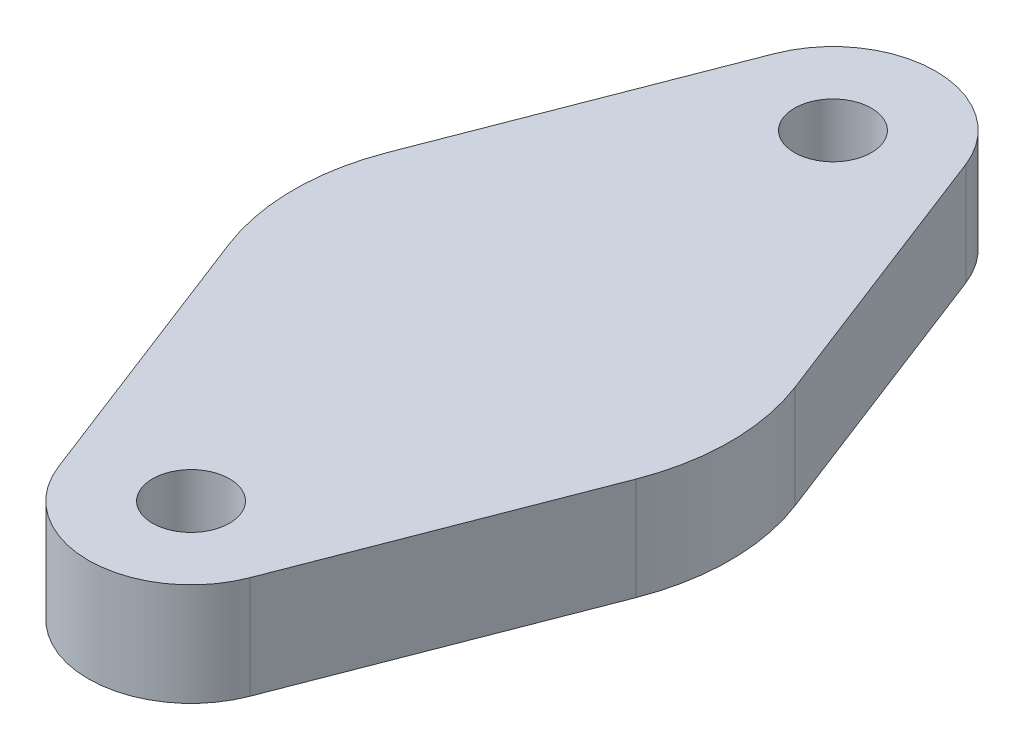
ISO-10303-21;
HEADER;
FILE_DESCRIPTION(('STEP AP214'),'2;1');
FILE_NAME('part.step','',(''),(''),'','','');
FILE_SCHEMA(('AUTOMOTIVE_DESIGN { 1 0 10303 214 1 1 1 1 }'));
ENDSEC;
DATA;
#1=APPLICATION_CONTEXT('core data for automotive mechanical design processes');
#2=APPLICATION_PROTOCOL_DEFINITION('international standard','automotive_design',2000,#1);
#3=PRODUCT_CONTEXT('',#1,'mechanical');
#4=PRODUCT('Part','Part','',(#3));
#5=PRODUCT_RELATED_PRODUCT_CATEGORY('part','',(#4));
#6=PRODUCT_DEFINITION_FORMATION('','',#4);
#7=PRODUCT_DEFINITION_CONTEXT('part definition',#1,'design');
#8=PRODUCT_DEFINITION('design','',#6,#7);
#9=PRODUCT_DEFINITION_SHAPE('','',#8);
#10=(LENGTH_UNIT() NAMED_UNIT(*) SI_UNIT(.MILLI.,.METRE.));
#11=(NAMED_UNIT(*) PLANE_ANGLE_UNIT() SI_UNIT($,.RADIAN.));
#12=(NAMED_UNIT(*) SI_UNIT($,.STERADIAN.) SOLID_ANGLE_UNIT());
#13=UNCERTAINTY_MEASURE_WITH_UNIT(LENGTH_MEASURE(1.E-05),#10,'distance_accuracy_value','');
#14=(GEOMETRIC_REPRESENTATION_CONTEXT(3) GLOBAL_UNCERTAINTY_ASSIGNED_CONTEXT((#13)) GLOBAL_UNIT_ASSIGNED_CONTEXT((#10,
#11,#12)) REPRESENTATION_CONTEXT('',''));
#15=CARTESIAN_POINT('',(0.,0.,0.));
#16=DIRECTION('',(0.,0.,1.));
#17=DIRECTION('',(1.,0.,0.));
#18=AXIS2_PLACEMENT_3D('',#15,#16,#17);
#19=CARTESIAN_POINT('',(0.,2.,0.));
#20=DIRECTION('',(0.,1.,0.));
#21=DIRECTION('',(0.,0.,1.));
#22=AXIS2_PLACEMENT_3D('',#19,#20,#21);
#23=PLANE('',#22);
#24=CARTESIAN_POINT('',(0.,2.,12.5));
#25=DIRECTION('',(0.,1.,0.));
#26=DIRECTION('',(0.,0.,1.));
#27=AXIS2_PLACEMENT_3D('',#24,#25,#26);
#28=CIRCLE('',#27,1.5);
#29=CARTESIAN_POINT('',(0.,2.,14.));
#30=VERTEX_POINT('',#29);
#31=EDGE_CURVE('E161',#30,#30,#28,.F.);
#32=ORIENTED_EDGE('',*,*,#31,.T.);
#33=EDGE_LOOP('',(#32));
#34=FACE_BOUND('',#33,.T.);
#35=CARTESIAN_POINT('',(0.,2.,-12.5));
#36=DIRECTION('',(0.,1.,0.));
#37=DIRECTION('',(0.,0.,1.));
#38=AXIS2_PLACEMENT_3D('',#35,#36,#37);
#39=CIRCLE('',#38,1.5);
#40=CARTESIAN_POINT('',(0.,2.,-11.));
#41=VERTEX_POINT('',#40);
#42=EDGE_CURVE('E165',#41,#41,#39,.F.);
#43=ORIENTED_EDGE('',*,*,#42,.T.);
#44=EDGE_LOOP('',(#43));
#45=FACE_BOUND('',#44,.T.);
#46=DIRECTION('',(-0.360538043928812,0.,-0.93274450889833));
#47=VECTOR('',#46,1.);
#48=CARTESIAN_POINT('',(7.921602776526,2.,-3.100627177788));
#49=LINE('',#48,#47);
#50=CARTESIAN_POINT('',(3.73097803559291,2.,-13.9421521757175));
#51=VERTEX_POINT('',#50);
#52=CARTESIAN_POINT('',(7.92160277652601,2.,-3.10062717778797));
#53=VERTEX_POINT('',#52);
#54=EDGE_CURVE('E111',#51,#53,#49,.F.);
#55=ORIENTED_EDGE('',*,*,#54,.F.);
#56=CARTESIAN_POINT('',(0.,2.,-12.5));
#57=DIRECTION('',(0.,1.,0.));
#58=DIRECTION('',(0.,0.,1.));
#59=AXIS2_PLACEMENT_3D('',#56,#57,#58);
#60=CIRCLE('',#59,4.);
#61=CARTESIAN_POINT('',(-3.73097803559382,2.,-13.9421521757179));
#62=VERTEX_POINT('',#61);
#63=EDGE_CURVE('E20',#62,#51,#60,.F.);
#64=ORIENTED_EDGE('',*,*,#63,.F.);
#65=DIRECTION('',(-0.360538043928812,0.,0.93274450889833));
#66=VECTOR('',#65,1.);
#67=CARTESIAN_POINT('',(-3.730978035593,2.,-13.94215217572));
#68=LINE('',#67,#66);
#69=CARTESIAN_POINT('',(-7.92160277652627,2.,-3.10062717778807));
#70=VERTEX_POINT('',#69);
#71=EDGE_CURVE('E96',#70,#62,#68,.F.);
#72=ORIENTED_EDGE('',*,*,#71,.F.);
#73=CARTESIAN_POINT('',(0.1,2.,0.));
#74=DIRECTION('',(0.,1.,0.));
#75=DIRECTION('',(0.,0.,1.));
#76=AXIS2_PLACEMENT_3D('',#73,#74,#75);
#77=CIRCLE('',#76,8.6);
#78=CARTESIAN_POINT('',(-7.92160277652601,2.,3.10062717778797));
#79=VERTEX_POINT('',#78);
#80=EDGE_CURVE('E120',#79,#70,#77,.F.);
#81=ORIENTED_EDGE('',*,*,#80,.F.);
#82=DIRECTION('',(0.360538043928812,0.,0.93274450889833));
#83=VECTOR('',#82,1.);
#84=CARTESIAN_POINT('',(-7.921602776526,2.,3.100627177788));
#85=LINE('',#84,#83);
#86=CARTESIAN_POINT('',(-3.73097803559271,2.,13.9421521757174));
#87=VERTEX_POINT('',#86);
#88=EDGE_CURVE('E137',#87,#79,#85,.F.);
#89=ORIENTED_EDGE('',*,*,#88,.F.);
#90=CARTESIAN_POINT('',(0.,2.,12.5));
#91=DIRECTION('',(0.,1.,0.));
#92=DIRECTION('',(0.,0.,1.));
#93=AXIS2_PLACEMENT_3D('',#90,#91,#92);
#94=CIRCLE('',#93,4.);
#95=CARTESIAN_POINT('',(3.73097803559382,2.,13.9421521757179));
#96=VERTEX_POINT('',#95);
#97=EDGE_CURVE('E173',#96,#87,#94,.F.);
#98=ORIENTED_EDGE('',*,*,#97,.F.);
#99=DIRECTION('',(0.360538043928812,0.,-0.93274450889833));
#100=VECTOR('',#99,1.);
#101=CARTESIAN_POINT('',(3.730978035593,2.,13.94215217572));
#102=LINE('',#101,#100);
#103=CARTESIAN_POINT('',(7.92160277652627,2.,3.10062717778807));
#104=VERTEX_POINT('',#103);
#105=EDGE_CURVE('E132',#104,#96,#102,.F.);
#106=ORIENTED_EDGE('',*,*,#105,.F.);
#107=CARTESIAN_POINT('',(-0.1,2.,0.));
#108=DIRECTION('',(0.,1.,0.));
#109=DIRECTION('',(0.,0.,1.));
#110=AXIS2_PLACEMENT_3D('',#107,#108,#109);
#111=CIRCLE('',#110,8.6);
#112=EDGE_CURVE('E169',#53,#104,#111,.F.);
#113=ORIENTED_EDGE('',*,*,#112,.F.);
#114=EDGE_LOOP('',(#55,#64,#72,#81,#89,#98,#106,#113));
#115=FACE_BOUND('',#114,.T.);
#116=ADVANCED_FACE('F17',(#34,#45,#115),#23,.T.);
#117=CARTESIAN_POINT('',(0.,-2.,-12.5));
#118=DIRECTION('',(0.,1.,0.));
#119=DIRECTION('',(0.,0.,1.));
#120=AXIS2_PLACEMENT_3D('',#117,#118,#119);
#121=CYLINDRICAL_SURFACE('',#120,4.);
#122=DIRECTION('',(0.,1.,0.));
#123=VECTOR('',#122,1.);
#124=CARTESIAN_POINT('',(3.73097803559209,-2.,-13.9421521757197));
#125=LINE('',#124,#123);
#126=CARTESIAN_POINT('',(3.73097803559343,-2.,-13.9421521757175));
#127=VERTEX_POINT('',#126);
#128=EDGE_CURVE('E131',#127,#51,#125,.T.);
#129=ORIENTED_EDGE('',*,*,#128,.F.);
#130=CARTESIAN_POINT('',(0.,-2.,-12.5));
#131=DIRECTION('',(0.,1.,0.));
#132=DIRECTION('',(0.,0.,1.));
#133=AXIS2_PLACEMENT_3D('',#130,#131,#132);
#134=CIRCLE('',#133,4.);
#135=CARTESIAN_POINT('',(-3.73097803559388,-2.,-13.9421521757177));
#136=VERTEX_POINT('',#135);
#137=EDGE_CURVE('E118',#127,#136,#134,.T.);
#138=ORIENTED_EDGE('',*,*,#137,.T.);
#139=DIRECTION('',(0.,1.,0.));
#140=VECTOR('',#139,1.);
#141=CARTESIAN_POINT('',(-3.730978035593,-2.,-13.94215217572));
#142=LINE('',#141,#140);
#143=EDGE_CURVE('E101',#62,#136,#142,.F.);
#144=ORIENTED_EDGE('',*,*,#143,.F.);
#145=ORIENTED_EDGE('',*,*,#63,.T.);
#146=EDGE_LOOP('',(#129,#138,#144,#145));
#147=FACE_BOUND('',#146,.T.);
#148=ADVANCED_FACE('F117',(#147),#121,.T.);
#149=CARTESIAN_POINT('',(-3.730978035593,-2.,-13.94215217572));
#150=DIRECTION('',(-0.93274450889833,0.,-0.360538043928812));
#151=DIRECTION('',(-0.360538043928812,0.,0.93274450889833));
#152=AXIS2_PLACEMENT_3D('',#149,#150,#151);
#153=PLANE('',#152);
#154=ORIENTED_EDGE('',*,*,#143,.T.);
#155=DIRECTION('',(-0.360538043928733,0.,0.93274450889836));
#156=VECTOR('',#155,1.);
#157=CARTESIAN_POINT('',(-3.730978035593,-2.,-13.94215217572));
#158=LINE('',#157,#156);
#159=CARTESIAN_POINT('',(-7.92160277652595,-2.,-3.10062717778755));
#160=VERTEX_POINT('',#159);
#161=EDGE_CURVE('E159',#136,#160,#158,.T.);
#162=ORIENTED_EDGE('',*,*,#161,.T.);
#163=DIRECTION('',(0.,1.,0.));
#164=VECTOR('',#163,1.);
#165=CARTESIAN_POINT('',(-7.92160277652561,-2.,-3.10062717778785));
#166=LINE('',#165,#164);
#167=EDGE_CURVE('E103',#70,#160,#166,.F.);
#168=ORIENTED_EDGE('',*,*,#167,.F.);
#169=ORIENTED_EDGE('',*,*,#71,.T.);
#170=EDGE_LOOP('',(#154,#162,#168,#169));
#171=FACE_BOUND('',#170,.T.);
#172=ADVANCED_FACE('F98',(#171),#153,.T.);
#173=CARTESIAN_POINT('',(0.1,-2.,0.));
#174=DIRECTION('',(0.,1.,0.));
#175=DIRECTION('',(0.,0.,1.));
#176=AXIS2_PLACEMENT_3D('',#173,#174,#175);
#177=CYLINDRICAL_SURFACE('',#176,8.6);
#178=ORIENTED_EDGE('',*,*,#167,.T.);
#179=CARTESIAN_POINT('',(0.1,-2.,0.));
#180=DIRECTION('',(0.,1.,0.));
#181=DIRECTION('',(0.,0.,1.));
#182=AXIS2_PLACEMENT_3D('',#179,#180,#181);
#183=CIRCLE('',#182,8.6);
#184=CARTESIAN_POINT('',(-7.92160277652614,-2.,3.10062717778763));
#185=VERTEX_POINT('',#184);
#186=EDGE_CURVE('E155',#160,#185,#183,.T.);
#187=ORIENTED_EDGE('',*,*,#186,.T.);
#188=DIRECTION('',(0.,1.,0.));
#189=VECTOR('',#188,1.);
#190=CARTESIAN_POINT('',(-7.921602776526,-2.,3.100627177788));
#191=LINE('',#190,#189);
#192=EDGE_CURVE('E139',#79,#185,#191,.F.);
#193=ORIENTED_EDGE('',*,*,#192,.F.);
#194=ORIENTED_EDGE('',*,*,#80,.T.);
#195=EDGE_LOOP('',(#178,#187,#193,#194));
#196=FACE_BOUND('',#195,.T.);
#197=ADVANCED_FACE('F219',(#196),#177,.T.);
#198=CARTESIAN_POINT('',(-7.921602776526,-2.,3.100627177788));
#199=DIRECTION('',(-0.93274450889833,0.,0.360538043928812));
#200=DIRECTION('',(0.360538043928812,0.,0.93274450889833));
#201=AXIS2_PLACEMENT_3D('',#198,#199,#200);
#202=PLANE('',#201);
#203=ORIENTED_EDGE('',*,*,#192,.T.);
#204=DIRECTION('',(0.360538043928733,0.,0.93274450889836));
#205=VECTOR('',#204,1.);
#206=CARTESIAN_POINT('',(-7.921602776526,-2.,3.100627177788));
#207=LINE('',#206,#205);
#208=CARTESIAN_POINT('',(-3.73097803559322,-2.,13.9421521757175));
#209=VERTEX_POINT('',#208);
#210=EDGE_CURVE('E154',#185,#209,#207,.T.);
#211=ORIENTED_EDGE('',*,*,#210,.T.);
#212=DIRECTION('',(0.,1.,0.));
#213=VECTOR('',#212,1.);
#214=CARTESIAN_POINT('',(-3.73097803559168,-2.,13.9421521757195));
#215=LINE('',#214,#213);
#216=EDGE_CURVE('E136',#87,#209,#215,.F.);
#217=ORIENTED_EDGE('',*,*,#216,.F.);
#218=ORIENTED_EDGE('',*,*,#88,.T.);
#219=EDGE_LOOP('',(#203,#211,#217,#218));
#220=FACE_BOUND('',#219,.T.);
#221=ADVANCED_FACE('F216',(#220),#202,.T.);
#222=CARTESIAN_POINT('',(0.,-2.,12.5));
#223=DIRECTION('',(0.,1.,0.));
#224=DIRECTION('',(0.,0.,1.));
#225=AXIS2_PLACEMENT_3D('',#222,#223,#224);
#226=CYLINDRICAL_SURFACE('',#225,4.);
#227=ORIENTED_EDGE('',*,*,#216,.T.);
#228=CARTESIAN_POINT('',(0.,-2.,12.5));
#229=DIRECTION('',(0.,1.,0.));
#230=DIRECTION('',(0.,0.,1.));
#231=AXIS2_PLACEMENT_3D('',#228,#229,#230);
#232=CIRCLE('',#231,4.);
#233=CARTESIAN_POINT('',(3.73097803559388,-2.,13.9421521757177));
#234=VERTEX_POINT('',#233);
#235=EDGE_CURVE('E150',#209,#234,#232,.T.);
#236=ORIENTED_EDGE('',*,*,#235,.T.);
#237=DIRECTION('',(0.,1.,0.));
#238=VECTOR('',#237,1.);
#239=CARTESIAN_POINT('',(3.730978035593,-2.,13.94215217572));
#240=LINE('',#239,#238);
#241=EDGE_CURVE('E135',#96,#234,#240,.F.);
#242=ORIENTED_EDGE('',*,*,#241,.F.);
#243=ORIENTED_EDGE('',*,*,#97,.T.);
#244=EDGE_LOOP('',(#227,#236,#242,#243));
#245=FACE_BOUND('',#244,.T.);
#246=ADVANCED_FACE('F214',(#245),#226,.T.);
#247=CARTESIAN_POINT('',(3.730978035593,-2.,13.94215217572));
#248=DIRECTION('',(0.93274450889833,0.,0.360538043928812));
#249=DIRECTION('',(0.360538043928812,0.,-0.93274450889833));
#250=AXIS2_PLACEMENT_3D('',#247,#248,#249);
#251=PLANE('',#250);
#252=ORIENTED_EDGE('',*,*,#241,.T.);
#253=DIRECTION('',(0.360538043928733,0.,-0.93274450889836));
#254=VECTOR('',#253,1.);
#255=CARTESIAN_POINT('',(3.730978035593,-2.,13.94215217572));
#256=LINE('',#255,#254);
#257=CARTESIAN_POINT('',(7.92160277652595,-2.,3.10062717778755));
#258=VERTEX_POINT('',#257);
#259=EDGE_CURVE('E149',#234,#258,#256,.T.);
#260=ORIENTED_EDGE('',*,*,#259,.T.);
#261=DIRECTION('',(0.,1.,0.));
#262=VECTOR('',#261,1.);
#263=CARTESIAN_POINT('',(7.92160277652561,-2.,3.10062717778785));
#264=LINE('',#263,#262);
#265=EDGE_CURVE('E172',#104,#258,#264,.F.);
#266=ORIENTED_EDGE('',*,*,#265,.F.);
#267=ORIENTED_EDGE('',*,*,#105,.T.);
#268=EDGE_LOOP('',(#252,#260,#266,#267));
#269=FACE_BOUND('',#268,.T.);
#270=ADVANCED_FACE('F212',(#269),#251,.T.);
#271=CARTESIAN_POINT('',(-0.1,-2.,0.));
#272=DIRECTION('',(0.,1.,0.));
#273=DIRECTION('',(0.,0.,1.));
#274=AXIS2_PLACEMENT_3D('',#271,#272,#273);
#275=CYLINDRICAL_SURFACE('',#274,8.6);
#276=ORIENTED_EDGE('',*,*,#265,.T.);
#277=CARTESIAN_POINT('',(-0.1,-2.,0.));
#278=DIRECTION('',(0.,1.,0.));
#279=DIRECTION('',(0.,0.,1.));
#280=AXIS2_PLACEMENT_3D('',#277,#278,#279);
#281=CIRCLE('',#280,8.6);
#282=CARTESIAN_POINT('',(7.92160277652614,-2.,-3.10062717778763));
#283=VERTEX_POINT('',#282);
#284=EDGE_CURVE('E145',#258,#283,#281,.T.);
#285=ORIENTED_EDGE('',*,*,#284,.T.);
#286=DIRECTION('',(0.,1.,0.));
#287=VECTOR('',#286,1.);
#288=CARTESIAN_POINT('',(7.921602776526,-2.,-3.100627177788));
#289=LINE('',#288,#287);
#290=EDGE_CURVE('E39',#53,#283,#289,.F.);
#291=ORIENTED_EDGE('',*,*,#290,.F.);
#292=ORIENTED_EDGE('',*,*,#112,.T.);
#293=EDGE_LOOP('',(#276,#285,#291,#292));
#294=FACE_BOUND('',#293,.T.);
#295=ADVANCED_FACE('F208',(#294),#275,.T.);
#296=CARTESIAN_POINT('',(7.921602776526,-2.,-3.100627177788));
#297=DIRECTION('',(0.93274450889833,0.,-0.360538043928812));
#298=DIRECTION('',(-0.360538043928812,0.,-0.93274450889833));
#299=AXIS2_PLACEMENT_3D('',#296,#297,#298);
#300=PLANE('',#299);
#301=ORIENTED_EDGE('',*,*,#290,.T.);
#302=DIRECTION('',(-0.360538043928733,0.,-0.93274450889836));
#303=VECTOR('',#302,1.);
#304=CARTESIAN_POINT('',(7.921602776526,-2.,-3.100627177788));
#305=LINE('',#304,#303);
#306=EDGE_CURVE('E144',#283,#127,#305,.T.);
#307=ORIENTED_EDGE('',*,*,#306,.T.);
#308=ORIENTED_EDGE('',*,*,#128,.T.);
#309=ORIENTED_EDGE('',*,*,#54,.T.);
#310=EDGE_LOOP('',(#301,#307,#308,#309));
#311=FACE_BOUND('',#310,.T.);
#312=ADVANCED_FACE('F202',(#311),#300,.T.);
#313=CARTESIAN_POINT('',(0.,-2.,-12.5));
#314=DIRECTION('',(0.,1.,0.));
#315=DIRECTION('',(0.,0.,1.));
#316=AXIS2_PLACEMENT_3D('',#313,#314,#315);
#317=CYLINDRICAL_SURFACE('',#316,1.5);
#318=ORIENTED_EDGE('',*,*,#42,.F.);
#319=EDGE_LOOP('',(#318));
#320=FACE_BOUND('',#319,.T.);
#321=CARTESIAN_POINT('',(0.,-2.,-12.5));
#322=DIRECTION('',(0.,1.,0.));
#323=DIRECTION('',(0.,0.,1.));
#324=AXIS2_PLACEMENT_3D('',#321,#322,#323);
#325=CIRCLE('',#324,1.5);
#326=CARTESIAN_POINT('',(0.,-2.,-11.));
#327=VERTEX_POINT('',#326);
#328=EDGE_CURVE('E27',#327,#327,#325,.F.);
#329=ORIENTED_EDGE('',*,*,#328,.T.);
#330=EDGE_LOOP('',(#329));
#331=FACE_BOUND('',#330,.T.);
#332=ADVANCED_FACE('F240',(#320,#331),#317,.F.);
#333=CARTESIAN_POINT('',(0.,-2.,12.5));
#334=DIRECTION('',(0.,1.,0.));
#335=DIRECTION('',(0.,0.,1.));
#336=AXIS2_PLACEMENT_3D('',#333,#334,#335);
#337=CYLINDRICAL_SURFACE('',#336,1.5);
#338=ORIENTED_EDGE('',*,*,#31,.F.);
#339=EDGE_LOOP('',(#338));
#340=FACE_BOUND('',#339,.T.);
#341=CARTESIAN_POINT('',(0.,-2.,12.5));
#342=DIRECTION('',(0.,1.,0.));
#343=DIRECTION('',(0.,0.,1.));
#344=AXIS2_PLACEMENT_3D('',#341,#342,#343);
#345=CIRCLE('',#344,1.5);
#346=CARTESIAN_POINT('',(0.,-2.,14.));
#347=VERTEX_POINT('',#346);
#348=EDGE_CURVE('E11',#347,#347,#345,.F.);
#349=ORIENTED_EDGE('',*,*,#348,.T.);
#350=EDGE_LOOP('',(#349));
#351=FACE_BOUND('',#350,.T.);
#352=ADVANCED_FACE('F233',(#340,#351),#337,.F.);
#353=CARTESIAN_POINT('',(0.,-2.,0.));
#354=DIRECTION('',(0.,1.,0.));
#355=DIRECTION('',(0.,0.,1.));
#356=AXIS2_PLACEMENT_3D('',#353,#354,#355);
#357=PLANE('',#356);
#358=ORIENTED_EDGE('',*,*,#348,.F.);
#359=EDGE_LOOP('',(#358));
#360=FACE_BOUND('',#359,.T.);
#361=ORIENTED_EDGE('',*,*,#328,.F.);
#362=EDGE_LOOP('',(#361));
#363=FACE_BOUND('',#362,.T.);
#364=ORIENTED_EDGE('',*,*,#284,.F.);
#365=ORIENTED_EDGE('',*,*,#259,.F.);
#366=ORIENTED_EDGE('',*,*,#235,.F.);
#367=ORIENTED_EDGE('',*,*,#210,.F.);
#368=ORIENTED_EDGE('',*,*,#186,.F.);
#369=ORIENTED_EDGE('',*,*,#161,.F.);
#370=ORIENTED_EDGE('',*,*,#137,.F.);
#371=ORIENTED_EDGE('',*,*,#306,.F.);
#372=EDGE_LOOP('',(#364,#365,#366,#367,#368,#369,#370,#371));
#373=FACE_BOUND('',#372,.T.);
#374=ADVANCED_FACE('F205',(#360,#363,#373),#357,.F.);
#375=CLOSED_SHELL('',(#116,#148,#172,#197,#221,#246,#270,#295,#312,#332,#352,#374));
#376=MANIFOLD_SOLID_BREP('B1',#375);
#377=ADVANCED_BREP_SHAPE_REPRESENTATION('',(#18,#376),#14);
#378=SHAPE_DEFINITION_REPRESENTATION(#9,#377);
ENDSEC;
END-ISO-10303-21;
